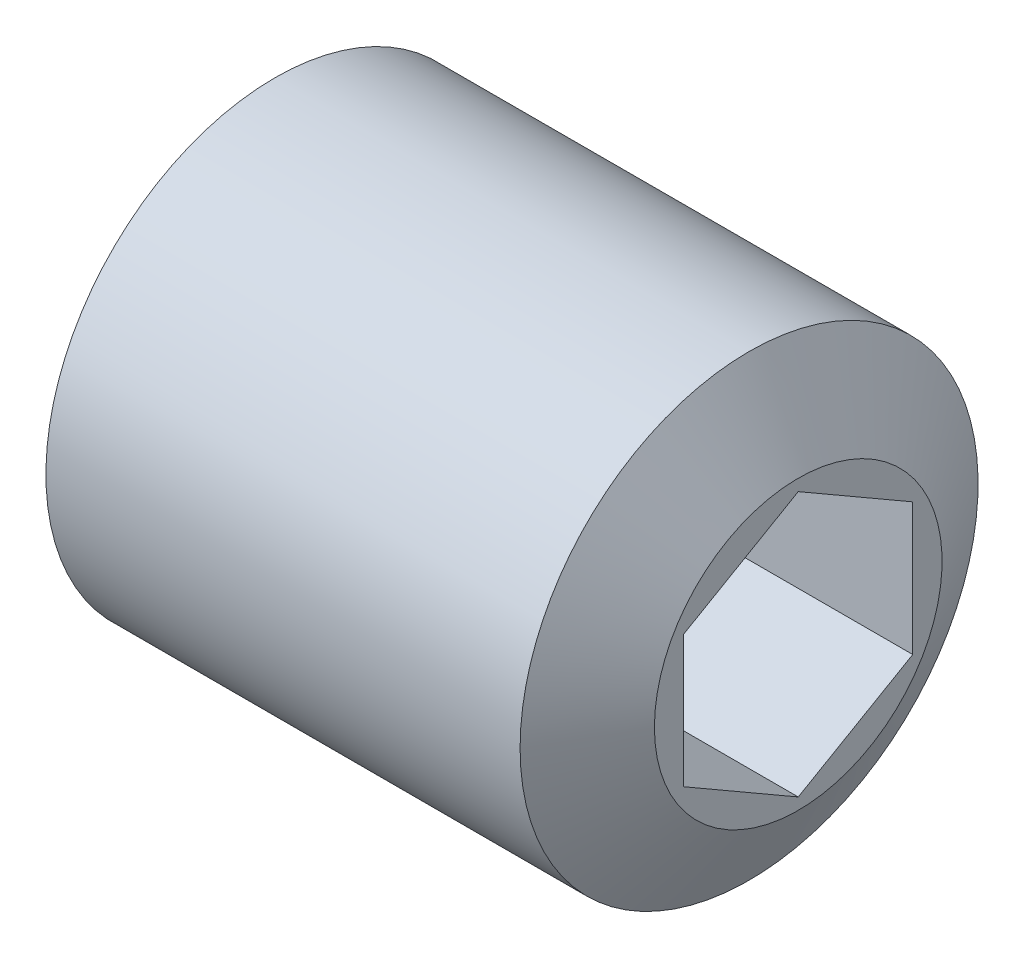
ISO-10303-21;
HEADER;
FILE_DESCRIPTION(('STEP AP214'),'2;1');
FILE_NAME('part.step','',(''),(''),'','','');
FILE_SCHEMA(('AUTOMOTIVE_DESIGN { 1 0 10303 214 1 1 1 1 }'));
ENDSEC;
DATA;
#1=APPLICATION_CONTEXT('core data for automotive mechanical design processes');
#2=APPLICATION_PROTOCOL_DEFINITION('international standard','automotive_design',2000,#1);
#3=PRODUCT_CONTEXT('',#1,'mechanical');
#4=PRODUCT('Part','Part','',(#3));
#5=PRODUCT_RELATED_PRODUCT_CATEGORY('part','',(#4));
#6=PRODUCT_DEFINITION_FORMATION('','',#4);
#7=PRODUCT_DEFINITION_CONTEXT('part definition',#1,'design');
#8=PRODUCT_DEFINITION('design','',#6,#7);
#9=PRODUCT_DEFINITION_SHAPE('','',#8);
#10=(LENGTH_UNIT() NAMED_UNIT(*) SI_UNIT(.MILLI.,.METRE.));
#11=(NAMED_UNIT(*) PLANE_ANGLE_UNIT() SI_UNIT($,.RADIAN.));
#12=(NAMED_UNIT(*) SI_UNIT($,.STERADIAN.) SOLID_ANGLE_UNIT());
#13=UNCERTAINTY_MEASURE_WITH_UNIT(LENGTH_MEASURE(1.E-05),#10,'distance_accuracy_value','');
#14=(GEOMETRIC_REPRESENTATION_CONTEXT(3) GLOBAL_UNCERTAINTY_ASSIGNED_CONTEXT((#13)) GLOBAL_UNIT_ASSIGNED_CONTEXT((#10,
#11,#12)) REPRESENTATION_CONTEXT('',''));
#15=CARTESIAN_POINT('',(0.,0.,0.));
#16=DIRECTION('',(0.,0.,1.));
#17=DIRECTION('',(1.,0.,0.));
#18=AXIS2_PLACEMENT_3D('',#15,#16,#17);
#19=CARTESIAN_POINT('',(3.50400000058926,0.,0.));
#20=DIRECTION('',(1.,0.,0.));
#21=DIRECTION('',(0.,0.,-1.));
#22=AXIS2_PLACEMENT_3D('',#19,#20,#21);
#23=CONICAL_SURFACE('',#22,1.16162874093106,1.04719754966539);
#24=CARTESIAN_POINT('',(2.83333333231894,-2.8421709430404E-10,0.));
#25=VERTEX_POINT('',#24);
#26=VERTEX_LOOP('',#25);
#27=FACE_BOUND('',#26,.T.);
#28=CARTESIAN_POINT('',(3.50000000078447,-0.577350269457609,0.999999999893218));
#29=CARTESIAN_POINT('',(3.48534777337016,-0.602721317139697,0.956056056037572));
#30=CARTESIAN_POINT('',(3.4720223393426,-0.628311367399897,0.911732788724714));
#31=CARTESIAN_POINT('',(3.44876319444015,-0.679934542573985,0.822318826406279));
#32=CARTESIAN_POINT('',(3.43883771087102,-0.705968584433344,0.777226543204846));
#33=CARTESIAN_POINT('',(3.42338798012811,-0.757714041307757,0.687600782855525));
#34=CARTESIAN_POINT('',(3.41776089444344,-0.783417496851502,0.64308109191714));
#35=CARTESIAN_POINT('',(3.41104458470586,-0.834945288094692,0.553832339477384));
#36=CARTESIAN_POINT('',(3.40994979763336,-0.86076943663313,0.509103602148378));
#37=CARTESIAN_POINT('',(3.41223314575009,-0.909019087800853,0.425532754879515));
#38=CARTESIAN_POINT('',(3.41505064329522,-0.931451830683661,0.386678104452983));
#39=CARTESIAN_POINT('',(3.42397865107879,-0.976171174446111,0.309221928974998));
#40=CARTESIAN_POINT('',(3.43009220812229,-0.998457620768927,0.270620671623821));
#41=CARTESIAN_POINT('',(3.4453749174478,-1.04326909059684,0.19300492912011));
#42=CARTESIAN_POINT('',(3.45460882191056,-1.0657884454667,0.154000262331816));
#43=CARTESIAN_POINT('',(3.4755658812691,-1.11049137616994,0.0765725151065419));
#44=CARTESIAN_POINT('',(3.48728411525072,-1.13267552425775,0.0381484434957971));
#45=CARTESIAN_POINT('',(3.50000000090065,-1.15470053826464,1.98479424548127E-10));
#46=B_SPLINE_CURVE_WITH_KNOTS('',3,(#28,#29,#30,#31,#32,#33,#34,#35,#36,#37,#38,#39,#40,#41,#42,
#43,#44,#45),.UNSPECIFIED.,.F.,.F.,(4,2,2,2,2,2,2,2,4),(0.,0.158508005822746,0.317396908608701,
0.472353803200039,0.627120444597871,0.76185389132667,0.896712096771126,1.03456081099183,
1.17213898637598),.UNSPECIFIED.);
#47=CARTESIAN_POINT('',(3.50000000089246,-0.577350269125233,0.999999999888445));
#48=VERTEX_POINT('',#47);
#49=CARTESIAN_POINT('',(3.50000000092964,-1.15470053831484,1.11533355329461E-10));
#50=VERTEX_POINT('',#49);
#51=EDGE_CURVE('E22',#48,#50,#46,.T.);
#52=ORIENTED_EDGE('',*,*,#51,.T.);
#53=CARTESIAN_POINT('',(3.50000000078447,-1.15470053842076,-2.85477728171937E-10));
#54=CARTESIAN_POINT('',(3.48534777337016,-1.12932949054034,-0.0439439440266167));
#55=CARTESIAN_POINT('',(3.4720223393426,-1.10373944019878,-0.0882672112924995));
#56=CARTESIAN_POINT('',(3.44876319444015,-1.05211626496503,-0.177681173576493));
#57=CARTESIAN_POINT('',(3.43883771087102,-1.02608222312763,-0.222773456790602));
#58=CARTESIAN_POINT('',(3.42338798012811,-0.974336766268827,-0.312399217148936));
#59=CARTESIAN_POINT('',(3.41776089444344,-0.948633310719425,-0.356918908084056));
#60=CARTESIAN_POINT('',(3.41104458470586,-0.897105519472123,-0.446167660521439));
#61=CARTESIAN_POINT('',(3.40994979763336,-0.871281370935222,-0.490896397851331));
#62=CARTESIAN_POINT('',(3.41223314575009,-0.823031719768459,-0.574467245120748));
#63=CARTESIAN_POINT('',(3.41505064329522,-0.800598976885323,-0.613321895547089));
#64=CARTESIAN_POINT('',(3.42397865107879,-0.755879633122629,-0.690778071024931));
#65=CARTESIAN_POINT('',(3.4300922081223,-0.733593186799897,-0.729379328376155));
#66=CARTESIAN_POINT('',(3.4453749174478,-0.688781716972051,-0.806995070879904));
#67=CARTESIAN_POINT('',(3.45460882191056,-0.666262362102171,-0.845999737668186));
#68=CARTESIAN_POINT('',(3.47556588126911,-0.621559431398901,-0.923427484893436));
#69=CARTESIAN_POINT('',(3.48728411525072,-0.599375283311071,-0.961851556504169));
#70=CARTESIAN_POINT('',(3.50000000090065,-0.577350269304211,-0.999999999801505));
#71=B_SPLINE_CURVE_WITH_KNOTS('',3,(#53,#54,#55,#56,#57,#58,#59,#60,#61,#62,#63,#64,#65,#66,#67,
#68,#69,#70),.UNSPECIFIED.,.F.,.F.,(4,2,2,2,2,2,2,2,4),(0.,0.158508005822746,0.317396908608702,
0.47235380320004,0.627120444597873,0.761853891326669,0.896712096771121,1.03456081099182,
1.17213898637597),.UNSPECIFIED.);
#72=CARTESIAN_POINT('',(3.50000000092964,-0.577350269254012,-0.999999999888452));
#73=VERTEX_POINT('',#72);
#74=EDGE_CURVE('E112',#50,#73,#71,.T.);
#75=ORIENTED_EDGE('',*,*,#74,.T.);
#76=CARTESIAN_POINT('',(3.50000000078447,-0.577350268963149,-1.00000000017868));
#77=CARTESIAN_POINT('',(3.48534777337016,-0.526608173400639,-1.00000000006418));
#78=CARTESIAN_POINT('',(3.4720223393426,-0.475428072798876,-1.00000000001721));
#79=CARTESIAN_POINT('',(3.44876319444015,-0.372181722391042,-0.999999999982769));
#80=CARTESIAN_POINT('',(3.43883771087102,-0.320113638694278,-0.999999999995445));
#81=CARTESIAN_POINT('',(3.42338798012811,-0.216622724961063,-1.00000000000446));
#82=CARTESIAN_POINT('',(3.41776089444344,-0.165215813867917,-1.0000000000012));
#83=CARTESIAN_POINT('',(3.41104458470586,-0.0621602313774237,-0.999999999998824));
#84=CARTESIAN_POINT('',(3.40994979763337,-0.0105119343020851,-0.999999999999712));
#85=CARTESIAN_POINT('',(3.41223314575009,0.0859873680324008,-1.00000000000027));
#86=CARTESIAN_POINT('',(3.41505064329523,0.130852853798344,-1.00000000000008));
#87=CARTESIAN_POINT('',(3.4239786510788,0.220291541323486,-0.999999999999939));
#88=CARTESIAN_POINT('',(3.4300922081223,0.264864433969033,-0.999999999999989));
#89=CARTESIAN_POINT('',(3.44537491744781,0.354487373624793,-1.00000000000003));
#90=CARTESIAN_POINT('',(3.45460882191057,0.399526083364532,-1.00000000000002));
#91=CARTESIAN_POINT('',(3.47556588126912,0.488931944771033,-0.999999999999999));
#92=CARTESIAN_POINT('',(3.48728411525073,0.533300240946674,-0.999999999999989));
#93=CARTESIAN_POINT('',(3.50000000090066,0.577350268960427,-1.00000000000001));
#94=B_SPLINE_CURVE_WITH_KNOTS('',3,(#76,#77,#78,#79,#80,#81,#82,#83,#84,#85,#86,#87,#88,#89,#90,
#91,#92,#93),.UNSPECIFIED.,.F.,.F.,(4,2,2,2,2,2,2,2,4),(0.,0.158508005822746,0.317396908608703,
0.472353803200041,0.627120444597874,0.761853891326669,0.89671209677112,1.03456081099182,
1.17213898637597),.UNSPECIFIED.);
#95=CARTESIAN_POINT('',(3.50000000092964,0.577350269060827,-0.999999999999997));
#96=VERTEX_POINT('',#95);
#97=EDGE_CURVE('E108',#73,#96,#94,.T.);
#98=ORIENTED_EDGE('',*,*,#97,.T.);
#99=CARTESIAN_POINT('',(3.50000000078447,0.577350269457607,-0.999999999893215));
#100=CARTESIAN_POINT('',(3.48534777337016,0.602721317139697,-0.956056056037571));
#101=CARTESIAN_POINT('',(3.4720223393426,0.628311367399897,-0.911732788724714));
#102=CARTESIAN_POINT('',(3.44876319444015,0.679934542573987,-0.822318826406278));
#103=CARTESIAN_POINT('',(3.43883771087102,0.705968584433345,-0.777226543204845));
#104=CARTESIAN_POINT('',(3.42338798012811,0.757714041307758,-0.687600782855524));
#105=CARTESIAN_POINT('',(3.41776089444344,0.783417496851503,-0.643081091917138));
#106=CARTESIAN_POINT('',(3.41104458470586,0.834945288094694,-0.553832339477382));
#107=CARTESIAN_POINT('',(3.40994979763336,0.860769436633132,-0.509103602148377));
#108=CARTESIAN_POINT('',(3.41223314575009,0.909019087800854,-0.425532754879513));
#109=CARTESIAN_POINT('',(3.41505064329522,0.931451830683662,-0.386678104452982));
#110=CARTESIAN_POINT('',(3.42397865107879,0.976171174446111,-0.309221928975));
#111=CARTESIAN_POINT('',(3.43009220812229,0.998457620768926,-0.270620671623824));
#112=CARTESIAN_POINT('',(3.4453749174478,1.04326909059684,-0.193004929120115));
#113=CARTESIAN_POINT('',(3.45460882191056,1.0657884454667,-0.154000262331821));
#114=CARTESIAN_POINT('',(3.4755658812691,1.11049137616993,-0.0765725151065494));
#115=CARTESIAN_POINT('',(3.48728411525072,1.13267552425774,-0.0381484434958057));
#116=CARTESIAN_POINT('',(3.50000000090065,1.15470053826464,-1.98488994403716E-10));
#117=B_SPLINE_CURVE_WITH_KNOTS('',3,(#99,#100,#101,#102,#103,#104,#105,#106,#107,#108,#109,#110,
#111,#112,#113,#114,#115,#116),.UNSPECIFIED.,.F.,.F.,(4,2,2,2,2,2,2,2,4),(0.,0.158508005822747,
0.317396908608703,0.472353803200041,0.627120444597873,0.761853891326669,0.896712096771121,
1.03456081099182,1.17213898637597),.UNSPECIFIED.);
#118=CARTESIAN_POINT('',(3.50000000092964,1.15470053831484,-1.11547263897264E-10));
#119=VERTEX_POINT('',#118);
#120=EDGE_CURVE('E104',#96,#119,#117,.T.);
#121=ORIENTED_EDGE('',*,*,#120,.T.);
#122=CARTESIAN_POINT('',(3.50000000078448,1.15470053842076,2.85464993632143E-10));
#123=CARTESIAN_POINT('',(3.48534777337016,1.12932949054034,0.0439439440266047));
#124=CARTESIAN_POINT('',(3.4720223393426,1.10373944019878,0.088267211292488));
#125=CARTESIAN_POINT('',(3.44876319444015,1.05211626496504,0.177681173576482));
#126=CARTESIAN_POINT('',(3.43883771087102,1.02608222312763,0.222773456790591));
#127=CARTESIAN_POINT('',(3.42338798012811,0.974336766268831,0.312399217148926));
#128=CARTESIAN_POINT('',(3.41776089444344,0.948633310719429,0.356918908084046));
#129=CARTESIAN_POINT('',(3.41104458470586,0.897105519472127,0.446167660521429));
#130=CARTESIAN_POINT('',(3.40994979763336,0.871281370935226,0.490896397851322));
#131=CARTESIAN_POINT('',(3.41223314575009,0.823031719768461,0.57446724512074));
#132=CARTESIAN_POINT('',(3.41505064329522,0.800598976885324,0.613321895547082));
#133=CARTESIAN_POINT('',(3.42397865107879,0.755879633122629,0.690778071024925));
#134=CARTESIAN_POINT('',(3.43009220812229,0.733593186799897,0.729379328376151));
#135=CARTESIAN_POINT('',(3.4453749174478,0.688781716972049,0.806995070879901));
#136=CARTESIAN_POINT('',(3.45460882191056,0.666262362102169,0.845999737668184));
#137=CARTESIAN_POINT('',(3.4755658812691,0.621559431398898,0.923427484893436));
#138=CARTESIAN_POINT('',(3.48728411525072,0.599375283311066,0.96185155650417));
#139=CARTESIAN_POINT('',(3.50000000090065,0.577350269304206,0.999999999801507));
#140=B_SPLINE_CURVE_WITH_KNOTS('',3,(#122,#123,#124,#125,#126,#127,#128,#129,#130,#131,#132,
#133,#134,#135,#136,#137,#138,#139),.UNSPECIFIED.,.F.,.F.,(4,2,2,2,2,2,2,2,4),(0.,
0.158508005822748,0.317396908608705,0.472353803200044,0.627120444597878,0.761853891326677,
0.896712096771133,1.03456081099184,1.17213898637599),.UNSPECIFIED.);
#141=CARTESIAN_POINT('',(3.50000000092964,0.577350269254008,0.999999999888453));
#142=VERTEX_POINT('',#141);
#143=EDGE_CURVE('E87',#119,#142,#140,.T.);
#144=ORIENTED_EDGE('',*,*,#143,.T.);
#145=CARTESIAN_POINT('',(3.50000000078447,0.577350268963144,1.00000000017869));
#146=CARTESIAN_POINT('',(3.48534777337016,0.526608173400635,1.00000000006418));
#147=CARTESIAN_POINT('',(3.4720223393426,0.475428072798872,1.00000000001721));
#148=CARTESIAN_POINT('',(3.44876319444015,0.372181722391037,0.999999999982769));
#149=CARTESIAN_POINT('',(3.43883771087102,0.320113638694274,0.999999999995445));
#150=CARTESIAN_POINT('',(3.42338798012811,0.216622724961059,1.00000000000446));
#151=CARTESIAN_POINT('',(3.41776089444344,0.165215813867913,1.0000000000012));
#152=CARTESIAN_POINT('',(3.41104458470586,0.0621602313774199,0.999999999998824));
#153=CARTESIAN_POINT('',(3.40994979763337,0.0105119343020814,0.999999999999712));
#154=CARTESIAN_POINT('',(3.41223314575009,-0.0859873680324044,1.00000000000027));
#155=CARTESIAN_POINT('',(3.41505064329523,-0.130852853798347,1.00000000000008));
#156=CARTESIAN_POINT('',(3.4239786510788,-0.22029154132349,0.999999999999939));
#157=CARTESIAN_POINT('',(3.4300922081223,-0.264864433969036,0.999999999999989));
#158=CARTESIAN_POINT('',(3.44537491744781,-0.354487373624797,1.00000000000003));
#159=CARTESIAN_POINT('',(3.45460882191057,-0.399526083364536,1.00000000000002));
#160=CARTESIAN_POINT('',(3.47556588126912,-0.488931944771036,0.999999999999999));
#161=CARTESIAN_POINT('',(3.48728411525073,-0.533300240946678,0.999999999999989));
#162=CARTESIAN_POINT('',(3.50000000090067,-0.577350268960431,1.00000000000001));
#163=B_SPLINE_CURVE_WITH_KNOTS('',3,(#145,#146,#147,#148,#149,#150,#151,#152,#153,#154,#155,
#156,#157,#158,#159,#160,#161,#162),.UNSPECIFIED.,.F.,.F.,(4,2,2,2,2,2,2,2,4),(0.,
0.158508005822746,0.317396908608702,0.47235380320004,0.627120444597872,0.761853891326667,
0.896712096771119,1.03456081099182,1.17213898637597),.UNSPECIFIED.);
#164=EDGE_CURVE('E85',#142,#48,#163,.T.);
#165=ORIENTED_EDGE('',*,*,#164,.T.);
#166=EDGE_LOOP('',(#52,#75,#98,#121,#144,#165));
#167=FACE_BOUND('',#166,.T.);
#168=ADVANCED_FACE('F18',(#27,#167),#23,.F.);
#169=CARTESIAN_POINT('',(5.,-0.577350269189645,0.999999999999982));
#170=DIRECTION('',(0.,-0.866025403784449,0.499999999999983));
#171=DIRECTION('',(0.,-0.499999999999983,-0.866025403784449));
#172=AXIS2_PLACEMENT_3D('',#169,#170,#171);
#173=PLANE('',#172);
#174=DIRECTION('',(1.,0.,0.));
#175=VECTOR('',#174,1.);
#176=CARTESIAN_POINT('',(5.,-0.577350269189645,1.00000000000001));
#177=LINE('',#176,#175);
#178=CARTESIAN_POINT('',(5.,-0.577350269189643,1.00000000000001));
#179=VERTEX_POINT('',#178);
#180=EDGE_CURVE('E78',#48,#179,#177,.T.);
#181=ORIENTED_EDGE('',*,*,#180,.T.);
#182=DIRECTION('',(0.,-0.499999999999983,-0.866025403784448));
#183=VECTOR('',#182,1.);
#184=CARTESIAN_POINT('',(5.,-0.577350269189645,0.999999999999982));
#185=LINE('',#184,#183);
#186=CARTESIAN_POINT('',(5.,-1.15470053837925,0.));
#187=VERTEX_POINT('',#186);
#188=EDGE_CURVE('E89',#179,#187,#185,.T.);
#189=ORIENTED_EDGE('',*,*,#188,.T.);
#190=DIRECTION('',(1.,0.,0.));
#191=VECTOR('',#190,1.);
#192=CARTESIAN_POINT('',(5.,-1.15470053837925,0.));
#193=LINE('',#192,#191);
#194=EDGE_CURVE('E81',#187,#50,#193,.F.);
#195=ORIENTED_EDGE('',*,*,#194,.T.);
#196=ORIENTED_EDGE('',*,*,#51,.F.);
#197=EDGE_LOOP('',(#181,#189,#195,#196));
#198=FACE_BOUND('',#197,.T.);
#199=ADVANCED_FACE('F76',(#198),#173,.F.);
#200=CARTESIAN_POINT('',(5.,-1.15470053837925,0.));
#201=DIRECTION('',(0.,-0.866025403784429,-0.500000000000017));
#202=DIRECTION('',(0.,0.500000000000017,-0.866025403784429));
#203=AXIS2_PLACEMENT_3D('',#200,#201,#202);
#204=PLANE('',#203);
#205=ORIENTED_EDGE('',*,*,#194,.F.);
#206=DIRECTION('',(0.,0.500000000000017,-0.866025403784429));
#207=VECTOR('',#206,1.);
#208=CARTESIAN_POINT('',(5.,-1.15470053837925,0.));
#209=LINE('',#208,#207);
#210=CARTESIAN_POINT('',(5.,-0.577350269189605,-1.00000000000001));
#211=VERTEX_POINT('',#210);
#212=EDGE_CURVE('E119',#187,#211,#209,.T.);
#213=ORIENTED_EDGE('',*,*,#212,.T.);
#214=DIRECTION('',(-1.,0.,0.));
#215=VECTOR('',#214,1.);
#216=CARTESIAN_POINT('',(5.,-0.577350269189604,-1.00000000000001));
#217=LINE('',#216,#215);
#218=EDGE_CURVE('E109',#211,#73,#217,.T.);
#219=ORIENTED_EDGE('',*,*,#218,.T.);
#220=ORIENTED_EDGE('',*,*,#74,.F.);
#221=EDGE_LOOP('',(#205,#213,#219,#220));
#222=FACE_BOUND('',#221,.T.);
#223=ADVANCED_FACE('F164',(#222),#204,.F.);
#224=CARTESIAN_POINT('',(5.,-0.577350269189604,-1.00000000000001));
#225=DIRECTION('',(0.,0.,-1.));
#226=DIRECTION('',(-1.,0.,0.));
#227=AXIS2_PLACEMENT_3D('',#224,#225,#226);
#228=PLANE('',#227);
#229=ORIENTED_EDGE('',*,*,#218,.F.);
#230=DIRECTION('',(0.,1.,0.));
#231=VECTOR('',#230,1.);
#232=CARTESIAN_POINT('',(5.,0.,-1.00000000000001));
#233=LINE('',#232,#231);
#234=CARTESIAN_POINT('',(5.,0.577350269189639,-0.999999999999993));
#235=VERTEX_POINT('',#234);
#236=EDGE_CURVE('E121',#211,#235,#233,.T.);
#237=ORIENTED_EDGE('',*,*,#236,.T.);
#238=DIRECTION('',(1.,0.,0.));
#239=VECTOR('',#238,1.);
#240=CARTESIAN_POINT('',(5.,0.577350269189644,-0.999999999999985));
#241=LINE('',#240,#239);
#242=EDGE_CURVE('E105',#235,#96,#241,.F.);
#243=ORIENTED_EDGE('',*,*,#242,.T.);
#244=ORIENTED_EDGE('',*,*,#97,.F.);
#245=EDGE_LOOP('',(#229,#237,#243,#244));
#246=FACE_BOUND('',#245,.T.);
#247=ADVANCED_FACE('F150',(#246),#228,.F.);
#248=CARTESIAN_POINT('',(5.,0.577350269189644,-0.999999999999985));
#249=DIRECTION('',(0.,0.866025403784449,-0.499999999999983));
#250=DIRECTION('',(0.,0.499999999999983,0.866025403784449));
#251=AXIS2_PLACEMENT_3D('',#248,#249,#250);
#252=PLANE('',#251);
#253=ORIENTED_EDGE('',*,*,#242,.F.);
#254=DIRECTION('',(0.,0.49999999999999,0.866025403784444));
#255=VECTOR('',#254,1.);
#256=CARTESIAN_POINT('',(5.,0.577350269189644,-0.999999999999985));
#257=LINE('',#256,#255);
#258=CARTESIAN_POINT('',(5.,1.15470053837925,0.));
#259=VERTEX_POINT('',#258);
#260=EDGE_CURVE('E115',#235,#259,#257,.T.);
#261=ORIENTED_EDGE('',*,*,#260,.T.);
#262=DIRECTION('',(1.,0.,0.));
#263=VECTOR('',#262,1.);
#264=CARTESIAN_POINT('',(5.,1.15470053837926,0.));
#265=LINE('',#264,#263);
#266=EDGE_CURVE('E98',#259,#119,#265,.F.);
#267=ORIENTED_EDGE('',*,*,#266,.T.);
#268=ORIENTED_EDGE('',*,*,#120,.F.);
#269=EDGE_LOOP('',(#253,#261,#267,#268));
#270=FACE_BOUND('',#269,.T.);
#271=ADVANCED_FACE('F146',(#270),#252,.F.);
#272=CARTESIAN_POINT('',(5.,1.15470053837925,0.));
#273=DIRECTION('',(0.,0.866025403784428,0.500000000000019));
#274=DIRECTION('',(0.,-0.500000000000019,0.866025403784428));
#275=AXIS2_PLACEMENT_3D('',#272,#273,#274);
#276=PLANE('',#275);
#277=ORIENTED_EDGE('',*,*,#266,.F.);
#278=DIRECTION('',(0.,-0.500000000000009,0.866025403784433));
#279=VECTOR('',#278,1.);
#280=CARTESIAN_POINT('',(5.,1.15470053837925,0.));
#281=LINE('',#280,#279);
#282=CARTESIAN_POINT('',(5.,0.577350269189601,1.00000000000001));
#283=VERTEX_POINT('',#282);
#284=EDGE_CURVE('E40',#259,#283,#281,.T.);
#285=ORIENTED_EDGE('',*,*,#284,.T.);
#286=DIRECTION('',(1.,0.,0.));
#287=VECTOR('',#286,1.);
#288=CARTESIAN_POINT('',(5.,0.577350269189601,1.00000000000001));
#289=LINE('',#288,#287);
#290=EDGE_CURVE('E90',#283,#142,#289,.F.);
#291=ORIENTED_EDGE('',*,*,#290,.T.);
#292=ORIENTED_EDGE('',*,*,#143,.F.);
#293=EDGE_LOOP('',(#277,#285,#291,#292));
#294=FACE_BOUND('',#293,.T.);
#295=ADVANCED_FACE('F141',(#294),#276,.F.);
#296=CARTESIAN_POINT('',(5.,0.577350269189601,1.00000000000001));
#297=DIRECTION('',(0.,0.,1.));
#298=DIRECTION('',(1.,0.,0.));
#299=AXIS2_PLACEMENT_3D('',#296,#297,#298);
#300=PLANE('',#299);
#301=ORIENTED_EDGE('',*,*,#290,.F.);
#302=DIRECTION('',(0.,1.,0.));
#303=VECTOR('',#302,1.);
#304=CARTESIAN_POINT('',(5.,0.,1.00000000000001));
#305=LINE('',#304,#303);
#306=EDGE_CURVE('E94',#283,#179,#305,.F.);
#307=ORIENTED_EDGE('',*,*,#306,.T.);
#308=ORIENTED_EDGE('',*,*,#180,.F.);
#309=ORIENTED_EDGE('',*,*,#164,.F.);
#310=EDGE_LOOP('',(#301,#307,#308,#309));
#311=FACE_BOUND('',#310,.T.);
#312=ADVANCED_FACE('F92',(#311),#300,.F.);
#313=CARTESIAN_POINT('',(5.,0.,0.));
#314=DIRECTION('',(-1.,0.,0.));
#315=DIRECTION('',(0.,0.,1.));
#316=AXIS2_PLACEMENT_3D('',#313,#314,#315);
#317=PLANE('',#316);
#318=ORIENTED_EDGE('',*,*,#284,.F.);
#319=ORIENTED_EDGE('',*,*,#260,.F.);
#320=ORIENTED_EDGE('',*,*,#236,.F.);
#321=ORIENTED_EDGE('',*,*,#212,.F.);
#322=ORIENTED_EDGE('',*,*,#188,.F.);
#323=ORIENTED_EDGE('',*,*,#306,.F.);
#324=EDGE_LOOP('',(#318,#319,#320,#321,#322,#323));
#325=FACE_BOUND('',#324,.T.);
#326=CARTESIAN_POINT('',(5.00000000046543,0.,0.));
#327=DIRECTION('',(-1.,0.,0.));
#328=DIRECTION('',(0.,0.,1.));
#329=AXIS2_PLACEMENT_3D('',#326,#327,#328);
#330=CIRCLE('',#329,1.25623140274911);
#331=CARTESIAN_POINT('',(5.00000000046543,0.,1.25623140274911));
#332=VERTEX_POINT('',#331);
#333=EDGE_CURVE('E117',#332,#332,#330,.T.);
#334=ORIENTED_EDGE('',*,*,#333,.F.);
#335=EDGE_LOOP('',(#334));
#336=FACE_BOUND('',#335,.T.);
#337=ADVANCED_FACE('F140',(#325,#336),#317,.F.);
#338=CARTESIAN_POINT('',(0.,0.999999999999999,0.));
#339=DIRECTION('',(-1.,0.,0.));
#340=DIRECTION('',(0.,0.,1.));
#341=AXIS2_PLACEMENT_3D('',#338,#339,#340);
#342=PLANE('',#341);
#343=CARTESIAN_POINT('',(-4.54747350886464E-10,0.,0.));
#344=DIRECTION('',(1.,0.,0.));
#345=DIRECTION('',(0.,0.,-1.));
#346=AXIS2_PLACEMENT_3D('',#343,#344,#345);
#347=CIRCLE('',#346,1.25623140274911);
#348=CARTESIAN_POINT('',(-4.54747367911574E-10,0.,-1.25623140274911));
#349=VERTEX_POINT('',#348);
#350=EDGE_CURVE('E124',#349,#349,#347,.T.);
#351=ORIENTED_EDGE('',*,*,#350,.F.);
#352=EDGE_LOOP('',(#351));
#353=FACE_BOUND('',#352,.T.);
#354=ADVANCED_FACE('F189',(#353),#342,.T.);
#355=CARTESIAN_POINT('',(4.57058499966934,0.,0.));
#356=DIRECTION('',(-1.,0.,0.));
#357=DIRECTION('',(0.,0.,1.));
#358=AXIS2_PLACEMENT_3D('',#355,#356,#357);
#359=CONICAL_SURFACE('',#358,1.9999999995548,1.04719754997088);
#360=ORIENTED_EDGE('',*,*,#333,.T.);
#361=EDGE_LOOP('',(#360));
#362=FACE_BOUND('',#361,.T.);
#363=CARTESIAN_POINT('',(4.570585,0.,0.));
#364=DIRECTION('',(1.,0.,0.));
#365=DIRECTION('',(0.,1.,0.));
#366=AXIS2_PLACEMENT_3D('',#363,#364,#365);
#367=CIRCLE('',#366,2.);
#368=CARTESIAN_POINT('',(4.570585,2.,0.));
#369=VERTEX_POINT('',#368);
#370=EDGE_CURVE('E31',#369,#369,#367,.F.);
#371=ORIENTED_EDGE('',*,*,#370,.F.);
#372=EDGE_LOOP('',(#371));
#373=FACE_BOUND('',#372,.T.);
#374=ADVANCED_FACE('F183',(#362,#373),#359,.T.);
#375=CARTESIAN_POINT('',(0.42941500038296,0.,0.));
#376=DIRECTION('',(1.,0.,0.));
#377=DIRECTION('',(0.,0.,-1.));
#378=AXIS2_PLACEMENT_3D('',#375,#376,#377);
#379=CONICAL_SURFACE('',#378,1.99999999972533,1.0471975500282);
#380=CARTESIAN_POINT('',(0.429415,0.,0.));
#381=DIRECTION('',(1.,0.,0.));
#382=DIRECTION('',(0.,1.,0.));
#383=AXIS2_PLACEMENT_3D('',#380,#381,#382);
#384=CIRCLE('',#383,2.);
#385=CARTESIAN_POINT('',(0.429415,2.,0.));
#386=VERTEX_POINT('',#385);
#387=EDGE_CURVE('E10',#386,#386,#384,.T.);
#388=ORIENTED_EDGE('',*,*,#387,.F.);
#389=EDGE_LOOP('',(#388));
#390=FACE_BOUND('',#389,.T.);
#391=ORIENTED_EDGE('',*,*,#350,.T.);
#392=EDGE_LOOP('',(#391));
#393=FACE_BOUND('',#392,.T.);
#394=ADVANCED_FACE('F177',(#390,#393),#379,.T.);
#395=CARTESIAN_POINT('',(2.5,0.,0.));
#396=DIRECTION('',(1.,0.,0.));
#397=DIRECTION('',(0.,1.,0.));
#398=AXIS2_PLACEMENT_3D('',#395,#396,#397);
#399=CYLINDRICAL_SURFACE('',#398,2.);
#400=ORIENTED_EDGE('',*,*,#387,.T.);
#401=EDGE_LOOP('',(#400));
#402=FACE_BOUND('',#401,.T.);
#403=ORIENTED_EDGE('',*,*,#370,.T.);
#404=EDGE_LOOP('',(#403));
#405=FACE_BOUND('',#404,.T.);
#406=ADVANCED_FACE('F175',(#402,#405),#399,.T.);
#407=CLOSED_SHELL('',(#168,#199,#223,#247,#271,#295,#312,#337,#354,#374,#394,#406));
#408=MANIFOLD_SOLID_BREP('B1',#407);
#409=ADVANCED_BREP_SHAPE_REPRESENTATION('',(#18,#408),#14);
#410=SHAPE_DEFINITION_REPRESENTATION(#9,#409);
ENDSEC;
END-ISO-10303-21;
